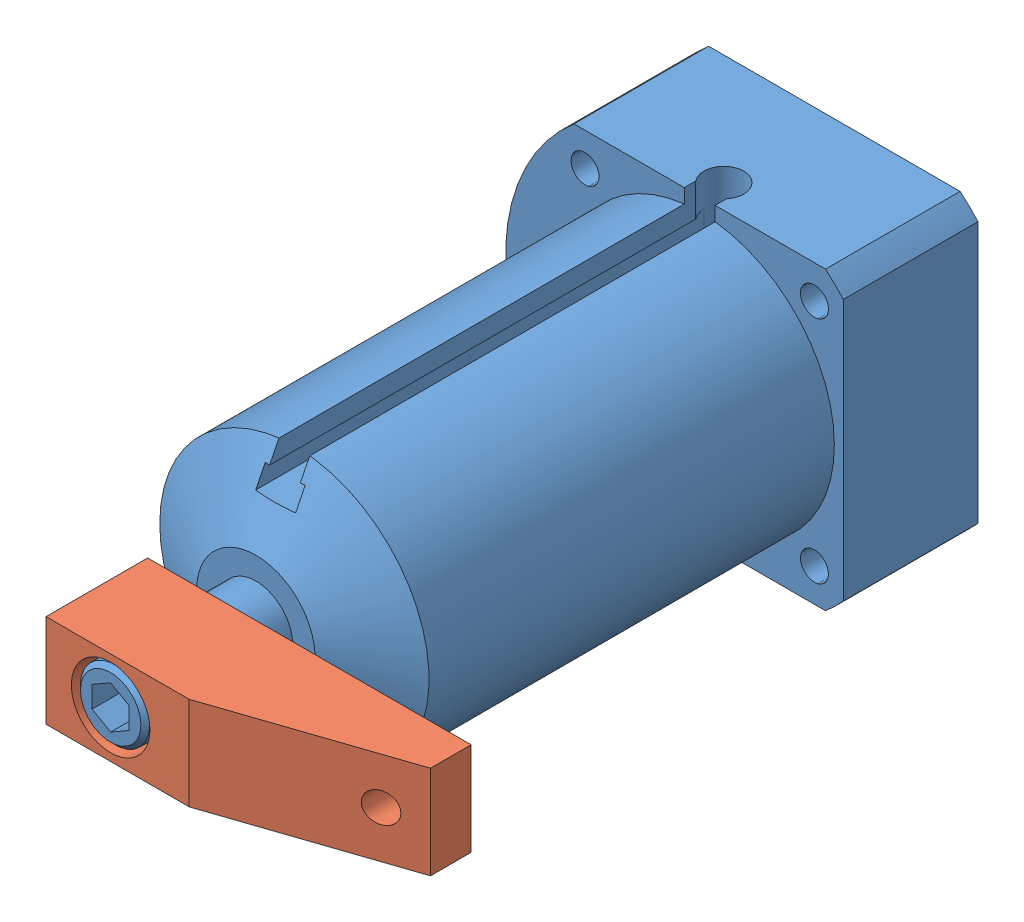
SolidWorks assembly ilcp1511700.sldasm, configuration Default (file format 4400). Lengths in mm.
Overall size (77.79 50.8 124.26).
2 component instances, 2 part files, 3 mates.
Components (placement in the parent):
- ilcp1511700-1: ilcp1511700.sldprt [Default] at origin size (58 50.8 124.26)
- ilc91500903-2: ilc91500903.SLDPRT [Default] at (-11.0998 -8.0518 106.807) x (0 1 0) z (1 0 0) size (16 17.45 55.55)
Mates (geometry in assembly coordinates):
- Coincident1: coincident aligned: circle of ilcp1511700-1; plane of ilc91500903-2 through (44.45 -8.0518 106.807) normal (0 0 -1)
- Concentric1: concentric aligned: cone of ilcp1511700-1 through (0 0 106.807) axis (0 0 1); cone of ilc91500903-2 through (0 0 113.4618) axis (0 0 1)
- Parallel1: parallel aligned: plane of ilcp1511700-1 through (24.6634 22.43 99.314) normal (1 0 0); plane of ilc91500903-2 through (44.45 -8.0518 124.2568) normal (1 0 0)
